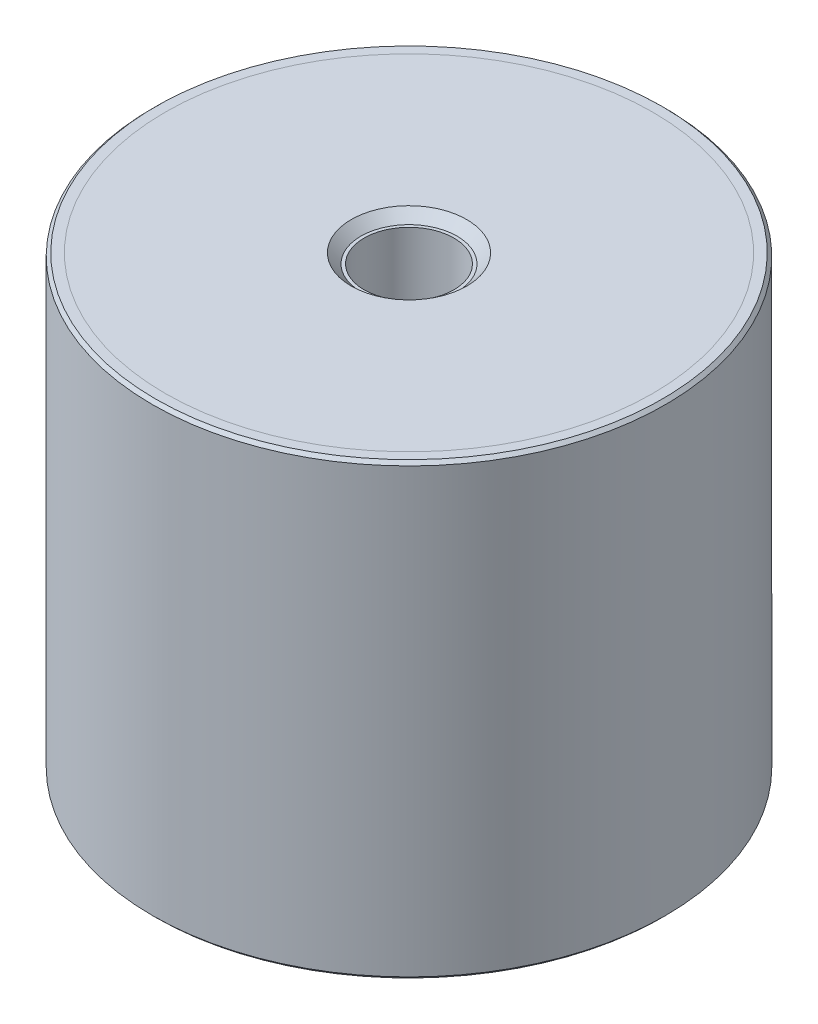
ISO-10303-21;
HEADER;
FILE_DESCRIPTION(('STEP AP214'),'2;1');
FILE_NAME('part.step','',(''),(''),'','','');
FILE_SCHEMA(('AUTOMOTIVE_DESIGN { 1 0 10303 214 1 1 1 1 }'));
ENDSEC;
DATA;
#1=APPLICATION_CONTEXT('core data for automotive mechanical design processes');
#2=APPLICATION_PROTOCOL_DEFINITION('international standard','automotive_design',2000,#1);
#3=PRODUCT_CONTEXT('',#1,'mechanical');
#4=PRODUCT('Part','Part','',(#3));
#5=PRODUCT_RELATED_PRODUCT_CATEGORY('part','',(#4));
#6=PRODUCT_DEFINITION_FORMATION('','',#4);
#7=PRODUCT_DEFINITION_CONTEXT('part definition',#1,'design');
#8=PRODUCT_DEFINITION('design','',#6,#7);
#9=PRODUCT_DEFINITION_SHAPE('','',#8);
#10=(LENGTH_UNIT() NAMED_UNIT(*) SI_UNIT(.MILLI.,.METRE.));
#11=(NAMED_UNIT(*) PLANE_ANGLE_UNIT() SI_UNIT($,.RADIAN.));
#12=(NAMED_UNIT(*) SI_UNIT($,.STERADIAN.) SOLID_ANGLE_UNIT());
#13=UNCERTAINTY_MEASURE_WITH_UNIT(LENGTH_MEASURE(1.E-05),#10,'distance_accuracy_value','');
#14=(GEOMETRIC_REPRESENTATION_CONTEXT(3) GLOBAL_UNCERTAINTY_ASSIGNED_CONTEXT((#13)) GLOBAL_UNIT_ASSIGNED_CONTEXT((#10,
#11,#12)) REPRESENTATION_CONTEXT('',''));
#15=CARTESIAN_POINT('',(0.,0.,0.));
#16=DIRECTION('',(0.,0.,1.));
#17=DIRECTION('',(1.,0.,0.));
#18=AXIS2_PLACEMENT_3D('',#15,#16,#17);
#19=CARTESIAN_POINT('',(0.,-67.,7.));
#20=DIRECTION('',(0.,1.,0.));
#21=DIRECTION('',(0.,0.,1.));
#22=AXIS2_PLACEMENT_3D('',#19,#20,#21);
#23=PLANE('',#22);
#24=CARTESIAN_POINT('',(0.,-67.,0.));
#25=DIRECTION('',(0.,1.,0.));
#26=DIRECTION('',(0.,0.,1.));
#27=AXIS2_PLACEMENT_3D('',#24,#25,#26);
#28=CIRCLE('',#27,7.50000000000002);
#29=CARTESIAN_POINT('',(0.,-67.,7.50000000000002));
#30=VERTEX_POINT('',#29);
#31=EDGE_CURVE('P0_E10',#30,#30,#28,.F.);
#32=ORIENTED_EDGE('',*,*,#31,.T.);
#33=EDGE_LOOP('',(#32));
#34=FACE_BOUND('',#33,.T.);
#35=CARTESIAN_POINT('',(0.,-67.,0.));
#36=DIRECTION('',(0.,1.,0.));
#37=DIRECTION('',(0.,0.,1.));
#38=AXIS2_PLACEMENT_3D('',#35,#36,#37);
#39=CIRCLE('',#38,38.);
#40=CARTESIAN_POINT('',(0.,-67.,38.));
#41=VERTEX_POINT('',#40);
#42=EDGE_CURVE('P0_E25',#41,#41,#39,.T.);
#43=ORIENTED_EDGE('',*,*,#42,.T.);
#44=EDGE_LOOP('',(#43));
#45=FACE_BOUND('',#44,.T.);
#46=ADVANCED_FACE('P0_F14',(#34,#45),#23,.T.);
#47=CARTESIAN_POINT('',(0.,1.0340428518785,0.));
#48=DIRECTION('',(0.,1.,0.));
#49=DIRECTION('',(0.,0.,1.));
#50=AXIS2_PLACEMENT_3D('',#47,#48,#49);
#51=CYLINDRICAL_SURFACE('',#50,38.);
#52=CARTESIAN_POINT('',(0.,-68.5,0.));
#53=DIRECTION('',(0.,1.,0.));
#54=DIRECTION('',(0.,0.,1.));
#55=AXIS2_PLACEMENT_3D('',#52,#53,#54);
#56=CIRCLE('',#55,38.);
#57=CARTESIAN_POINT('',(0.,-68.5,38.));
#58=VERTEX_POINT('',#57);
#59=EDGE_CURVE('P0_E29',#58,#58,#56,.T.);
#60=ORIENTED_EDGE('',*,*,#59,.T.);
#61=EDGE_LOOP('',(#60));
#62=FACE_BOUND('',#61,.T.);
#63=ORIENTED_EDGE('',*,*,#42,.F.);
#64=EDGE_LOOP('',(#63));
#65=FACE_BOUND('',#64,.T.);
#66=ADVANCED_FACE('P0_F35',(#62,#65),#51,.T.);
#67=CARTESIAN_POINT('',(0.,-68.5,38.));
#68=DIRECTION('',(0.,-1.,0.));
#69=DIRECTION('',(0.,0.,-1.));
#70=AXIS2_PLACEMENT_3D('',#67,#68,#69);
#71=PLANE('',#70);
#72=CARTESIAN_POINT('',(0.,-68.5,0.));
#73=DIRECTION('',(0.,-1.,0.));
#74=DIRECTION('',(0.,0.,-1.));
#75=AXIS2_PLACEMENT_3D('',#72,#73,#74);
#76=CIRCLE('',#75,9.00000000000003);
#77=CARTESIAN_POINT('',(0.,-68.5,-9.00000000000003));
#78=VERTEX_POINT('',#77);
#79=EDGE_CURVE('P0_E21',#78,#78,#76,.F.);
#80=ORIENTED_EDGE('',*,*,#79,.T.);
#81=EDGE_LOOP('',(#80));
#82=FACE_BOUND('',#81,.T.);
#83=ORIENTED_EDGE('',*,*,#59,.F.);
#84=EDGE_LOOP('',(#83));
#85=FACE_BOUND('',#84,.T.);
#86=ADVANCED_FACE('P0_F38',(#82,#85),#71,.T.);
#87=CARTESIAN_POINT('',(0.,-68.5,0.));
#88=DIRECTION('',(0.,-1.,0.));
#89=DIRECTION('',(0.,0.,-1.));
#90=AXIS2_PLACEMENT_3D('',#87,#88,#89);
#91=CONICAL_SURFACE('',#90,9.00000000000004,0.785398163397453);
#92=ORIENTED_EDGE('',*,*,#31,.F.);
#93=EDGE_LOOP('',(#92));
#94=FACE_BOUND('',#93,.T.);
#95=ORIENTED_EDGE('',*,*,#79,.F.);
#96=EDGE_LOOP('',(#95));
#97=FACE_BOUND('',#96,.T.);
#98=ADVANCED_FACE('P0_F16',(#94,#97),#91,.F.);
#99=CLOSED_SHELL('',(#46,#66,#86,#98));
#100=MANIFOLD_SOLID_BREP('P0_B1',#99);
#101=CARTESIAN_POINT('',(0.,1.5,7.));
#102=DIRECTION('',(0.,1.,0.));
#103=DIRECTION('',(0.,0.,1.));
#104=AXIS2_PLACEMENT_3D('',#101,#102,#103);
#105=PLANE('',#104);
#106=CARTESIAN_POINT('',(0.,1.5,0.));
#107=DIRECTION('',(0.,1.,0.));
#108=DIRECTION('',(0.,0.,1.));
#109=AXIS2_PLACEMENT_3D('',#106,#107,#108);
#110=CIRCLE('',#109,9.00000000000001);
#111=CARTESIAN_POINT('',(0.,1.5,9.00000000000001));
#112=VERTEX_POINT('',#111);
#113=EDGE_CURVE('P1_E10',#112,#112,#110,.F.);
#114=ORIENTED_EDGE('',*,*,#113,.T.);
#115=EDGE_LOOP('',(#114));
#116=FACE_BOUND('',#115,.T.);
#117=CARTESIAN_POINT('',(0.,1.5,0.));
#118=DIRECTION('',(0.,1.,0.));
#119=DIRECTION('',(0.,0.,1.));
#120=AXIS2_PLACEMENT_3D('',#117,#118,#119);
#121=CIRCLE('',#120,38.);
#122=CARTESIAN_POINT('',(0.,1.5,38.));
#123=VERTEX_POINT('',#122);
#124=EDGE_CURVE('P1_E25',#123,#123,#121,.T.);
#125=ORIENTED_EDGE('',*,*,#124,.T.);
#126=EDGE_LOOP('',(#125));
#127=FACE_BOUND('',#126,.T.);
#128=ADVANCED_FACE('P1_F14',(#116,#127),#105,.T.);
#129=CARTESIAN_POINT('',(0.,69.5340428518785,0.));
#130=DIRECTION('',(0.,1.,0.));
#131=DIRECTION('',(0.,0.,1.));
#132=AXIS2_PLACEMENT_3D('',#129,#130,#131);
#133=CYLINDRICAL_SURFACE('',#132,38.);
#134=CARTESIAN_POINT('',(0.,0.,0.));
#135=DIRECTION('',(0.,1.,0.));
#136=DIRECTION('',(0.,0.,1.));
#137=AXIS2_PLACEMENT_3D('',#134,#135,#136);
#138=CIRCLE('',#137,38.);
#139=CARTESIAN_POINT('',(0.,0.,38.));
#140=VERTEX_POINT('',#139);
#141=EDGE_CURVE('P1_E29',#140,#140,#138,.T.);
#142=ORIENTED_EDGE('',*,*,#141,.T.);
#143=EDGE_LOOP('',(#142));
#144=FACE_BOUND('',#143,.T.);
#145=ORIENTED_EDGE('',*,*,#124,.F.);
#146=EDGE_LOOP('',(#145));
#147=FACE_BOUND('',#146,.T.);
#148=ADVANCED_FACE('P1_F35',(#144,#147),#133,.T.);
#149=CARTESIAN_POINT('',(0.,0.,38.));
#150=DIRECTION('',(0.,-1.,0.));
#151=DIRECTION('',(0.,0.,-1.));
#152=AXIS2_PLACEMENT_3D('',#149,#150,#151);
#153=PLANE('',#152);
#154=CARTESIAN_POINT('',(0.,0.,0.));
#155=DIRECTION('',(0.,-1.,0.));
#156=DIRECTION('',(0.,0.,-1.));
#157=AXIS2_PLACEMENT_3D('',#154,#155,#156);
#158=CIRCLE('',#157,7.50000000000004);
#159=CARTESIAN_POINT('',(0.,0.,-7.50000000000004));
#160=VERTEX_POINT('',#159);
#161=EDGE_CURVE('P1_E21',#160,#160,#158,.F.);
#162=ORIENTED_EDGE('',*,*,#161,.T.);
#163=EDGE_LOOP('',(#162));
#164=FACE_BOUND('',#163,.T.);
#165=ORIENTED_EDGE('',*,*,#141,.F.);
#166=EDGE_LOOP('',(#165));
#167=FACE_BOUND('',#166,.T.);
#168=ADVANCED_FACE('P1_F38',(#164,#167),#153,.T.);
#169=CARTESIAN_POINT('',(0.,-0.500000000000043,0.));
#170=DIRECTION('',(0.,1.,0.));
#171=DIRECTION('',(0.,0.,1.));
#172=AXIS2_PLACEMENT_3D('',#169,#170,#171);
#173=CONICAL_SURFACE('',#172,7.,0.785398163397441);
#174=ORIENTED_EDGE('',*,*,#113,.F.);
#175=EDGE_LOOP('',(#174));
#176=FACE_BOUND('',#175,.T.);
#177=ORIENTED_EDGE('',*,*,#161,.F.);
#178=EDGE_LOOP('',(#177));
#179=FACE_BOUND('',#178,.T.);
#180=ADVANCED_FACE('P1_F16',(#176,#179),#173,.F.);
#181=CLOSED_SHELL('',(#128,#148,#168,#180));
#182=MANIFOLD_SOLID_BREP('P1_B1',#181);
#183=CARTESIAN_POINT('',(0.,0.,0.));
#184=DIRECTION('',(0.,1.,0.));
#185=DIRECTION('',(0.,0.,1.));
#186=AXIS2_PLACEMENT_3D('',#183,#184,#185);
#187=PLANE('',#186);
#188=CARTESIAN_POINT('',(0.,0.,0.));
#189=DIRECTION('',(0.,1.,0.));
#190=DIRECTION('',(0.,0.,1.));
#191=AXIS2_PLACEMENT_3D('',#188,#189,#190);
#192=CIRCLE('',#191,7.);
#193=CARTESIAN_POINT('',(0.,0.,7.));
#194=VERTEX_POINT('',#193);
#195=EDGE_CURVE('P2_E46',#194,#194,#192,.T.);
#196=ORIENTED_EDGE('',*,*,#195,.F.);
#197=EDGE_LOOP('',(#196));
#198=FACE_BOUND('',#197,.T.);
#199=CARTESIAN_POINT('',(0.,0.,0.));
#200=DIRECTION('',(0.,1.,0.));
#201=DIRECTION('',(0.,0.,1.));
#202=AXIS2_PLACEMENT_3D('',#199,#200,#201);
#203=CIRCLE('',#202,38.);
#204=CARTESIAN_POINT('',(0.,0.,38.));
#205=VERTEX_POINT('',#204);
#206=EDGE_CURVE('P2_E33',#205,#205,#203,.T.);
#207=ORIENTED_EDGE('',*,*,#206,.T.);
#208=EDGE_LOOP('',(#207));
#209=FACE_BOUND('',#208,.T.);
#210=ADVANCED_FACE('P2_F13',(#198,#209),#187,.T.);
#211=CARTESIAN_POINT('',(0.,65.5134936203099,0.));
#212=DIRECTION('',(0.,1.,0.));
#213=DIRECTION('',(0.,0.,1.));
#214=AXIS2_PLACEMENT_3D('',#211,#212,#213);
#215=CYLINDRICAL_SURFACE('',#214,38.);
#216=CARTESIAN_POINT('',(0.,1.5,0.));
#217=DIRECTION('',(0.,1.,0.));
#218=DIRECTION('',(0.,0.,1.));
#219=AXIS2_PLACEMENT_3D('',#216,#217,#218);
#220=CIRCLE('',#219,38.);
#221=CARTESIAN_POINT('',(0.,1.5,38.));
#222=VERTEX_POINT('',#221);
#223=EDGE_CURVE('P2_E36',#222,#222,#220,.T.);
#224=ORIENTED_EDGE('',*,*,#223,.T.);
#225=EDGE_LOOP('',(#224));
#226=FACE_BOUND('',#225,.T.);
#227=ORIENTED_EDGE('',*,*,#206,.F.);
#228=EDGE_LOOP('',(#227));
#229=FACE_BOUND('',#228,.T.);
#230=ADVANCED_FACE('P2_F92',(#226,#229),#215,.F.);
#231=CARTESIAN_POINT('',(0.,1.5,38.));
#232=DIRECTION('',(0.,1.,0.));
#233=DIRECTION('',(0.,0.,1.));
#234=AXIS2_PLACEMENT_3D('',#231,#232,#233);
#235=PLANE('',#234);
#236=CARTESIAN_POINT('',(0.,1.5,0.));
#237=DIRECTION('',(0.,1.,0.));
#238=DIRECTION('',(0.,0.,1.));
#239=AXIS2_PLACEMENT_3D('',#236,#237,#238);
#240=CIRCLE('',#239,39.5);
#241=CARTESIAN_POINT('',(0.,1.5,39.5));
#242=VERTEX_POINT('',#241);
#243=EDGE_CURVE('P2_E9',#242,#242,#240,.T.);
#244=ORIENTED_EDGE('',*,*,#243,.T.);
#245=EDGE_LOOP('',(#244));
#246=FACE_BOUND('',#245,.T.);
#247=ORIENTED_EDGE('',*,*,#223,.F.);
#248=EDGE_LOOP('',(#247));
#249=FACE_BOUND('',#248,.T.);
#250=ADVANCED_FACE('P2_F88',(#246,#249),#235,.T.);
#251=CARTESIAN_POINT('',(0.,65.5134936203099,0.));
#252=DIRECTION('',(0.,1.,0.));
#253=DIRECTION('',(0.,0.,1.));
#254=AXIS2_PLACEMENT_3D('',#251,#252,#253);
#255=CYLINDRICAL_SURFACE('',#254,40.);
#256=CARTESIAN_POINT('',(0.,-68.,0.));
#257=DIRECTION('',(0.,-1.,0.));
#258=DIRECTION('',(0.,0.,-1.));
#259=AXIS2_PLACEMENT_3D('',#256,#257,#258);
#260=CIRCLE('',#259,40.);
#261=CARTESIAN_POINT('',(0.,-68.,-40.));
#262=VERTEX_POINT('',#261);
#263=EDGE_CURVE('P2_E24',#262,#262,#260,.F.);
#264=ORIENTED_EDGE('',*,*,#263,.T.);
#265=EDGE_LOOP('',(#264));
#266=FACE_BOUND('',#265,.T.);
#267=CARTESIAN_POINT('',(0.,1.00000000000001,0.));
#268=DIRECTION('',(0.,1.,0.));
#269=DIRECTION('',(0.,0.,1.));
#270=AXIS2_PLACEMENT_3D('',#267,#268,#269);
#271=CIRCLE('',#270,40.);
#272=CARTESIAN_POINT('',(0.,1.00000000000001,40.));
#273=VERTEX_POINT('',#272);
#274=EDGE_CURVE('P2_E28',#273,#273,#271,.F.);
#275=ORIENTED_EDGE('',*,*,#274,.T.);
#276=EDGE_LOOP('',(#275));
#277=FACE_BOUND('',#276,.T.);
#278=ADVANCED_FACE('P2_F82',(#266,#277),#255,.T.);
#279=CARTESIAN_POINT('',(0.,-68.5,40.));
#280=DIRECTION('',(0.,-1.,0.));
#281=DIRECTION('',(0.,0.,-1.));
#282=AXIS2_PLACEMENT_3D('',#279,#280,#281);
#283=PLANE('',#282);
#284=CARTESIAN_POINT('',(0.,-68.5,0.));
#285=DIRECTION('',(0.,-1.,0.));
#286=DIRECTION('',(0.,0.,-1.));
#287=AXIS2_PLACEMENT_3D('',#284,#285,#286);
#288=CIRCLE('',#287,39.5);
#289=CARTESIAN_POINT('',(0.,-68.5,-39.5));
#290=VERTEX_POINT('',#289);
#291=EDGE_CURVE('P2_E20',#290,#290,#288,.T.);
#292=ORIENTED_EDGE('',*,*,#291,.T.);
#293=EDGE_LOOP('',(#292));
#294=FACE_BOUND('',#293,.T.);
#295=CARTESIAN_POINT('',(0.,-68.5,0.));
#296=DIRECTION('',(0.,1.,0.));
#297=DIRECTION('',(0.,0.,1.));
#298=AXIS2_PLACEMENT_3D('',#295,#296,#297);
#299=CIRCLE('',#298,38.);
#300=CARTESIAN_POINT('',(0.,-68.5,38.));
#301=VERTEX_POINT('',#300);
#302=EDGE_CURVE('P2_E39',#301,#301,#299,.T.);
#303=ORIENTED_EDGE('',*,*,#302,.T.);
#304=EDGE_LOOP('',(#303));
#305=FACE_BOUND('',#304,.T.);
#306=ADVANCED_FACE('P2_F77',(#294,#305),#283,.T.);
#307=CARTESIAN_POINT('',(0.,65.5134936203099,0.));
#308=DIRECTION('',(0.,1.,0.));
#309=DIRECTION('',(0.,0.,1.));
#310=AXIS2_PLACEMENT_3D('',#307,#308,#309);
#311=CYLINDRICAL_SURFACE('',#310,38.);
#312=CARTESIAN_POINT('',(0.,-67.,0.));
#313=DIRECTION('',(0.,1.,0.));
#314=DIRECTION('',(0.,0.,1.));
#315=AXIS2_PLACEMENT_3D('',#312,#313,#314);
#316=CIRCLE('',#315,38.);
#317=CARTESIAN_POINT('',(0.,-67.,38.));
#318=VERTEX_POINT('',#317);
#319=EDGE_CURVE('P2_E42',#318,#318,#316,.T.);
#320=ORIENTED_EDGE('',*,*,#319,.T.);
#321=EDGE_LOOP('',(#320));
#322=FACE_BOUND('',#321,.T.);
#323=ORIENTED_EDGE('',*,*,#302,.F.);
#324=EDGE_LOOP('',(#323));
#325=FACE_BOUND('',#324,.T.);
#326=ADVANCED_FACE('P2_F71',(#322,#325),#311,.F.);
#327=CARTESIAN_POINT('',(0.,-67.,38.));
#328=DIRECTION('',(0.,-1.,0.));
#329=DIRECTION('',(0.,0.,-1.));
#330=AXIS2_PLACEMENT_3D('',#327,#328,#329);
#331=PLANE('',#330);
#332=CARTESIAN_POINT('',(0.,-67.,0.));
#333=DIRECTION('',(0.,-1.,0.));
#334=DIRECTION('',(0.,0.,-1.));
#335=AXIS2_PLACEMENT_3D('',#332,#333,#334);
#336=CIRCLE('',#335,7.);
#337=CARTESIAN_POINT('',(0.,-67.,-7.));
#338=VERTEX_POINT('',#337);
#339=EDGE_CURVE('P2_E52',#338,#338,#336,.T.);
#340=ORIENTED_EDGE('',*,*,#339,.F.);
#341=EDGE_LOOP('',(#340));
#342=FACE_BOUND('',#341,.T.);
#343=ORIENTED_EDGE('',*,*,#319,.F.);
#344=EDGE_LOOP('',(#343));
#345=FACE_BOUND('',#344,.T.);
#346=ADVANCED_FACE('P2_F67',(#342,#345),#331,.T.);
#347=CARTESIAN_POINT('',(0.,-68.,0.));
#348=DIRECTION('',(0.,1.,0.));
#349=DIRECTION('',(0.,0.,1.));
#350=AXIS2_PLACEMENT_3D('',#347,#348,#349);
#351=CONICAL_SURFACE('',#350,40.,0.785398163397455);
#352=ORIENTED_EDGE('',*,*,#291,.F.);
#353=EDGE_LOOP('',(#352));
#354=FACE_BOUND('',#353,.T.);
#355=ORIENTED_EDGE('',*,*,#263,.F.);
#356=EDGE_LOOP('',(#355));
#357=FACE_BOUND('',#356,.T.);
#358=ADVANCED_FACE('P2_F70',(#354,#357),#351,.T.);
#359=CARTESIAN_POINT('',(0.,1.5,0.));
#360=DIRECTION('',(0.,-1.,0.));
#361=DIRECTION('',(0.,0.,-1.));
#362=AXIS2_PLACEMENT_3D('',#359,#360,#361);
#363=CONICAL_SURFACE('',#362,39.5,0.785398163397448);
#364=ORIENTED_EDGE('',*,*,#274,.F.);
#365=EDGE_LOOP('',(#364));
#366=FACE_BOUND('',#365,.T.);
#367=ORIENTED_EDGE('',*,*,#243,.F.);
#368=EDGE_LOOP('',(#367));
#369=FACE_BOUND('',#368,.T.);
#370=ADVANCED_FACE('P2_F15',(#366,#369),#363,.T.);
#371=CARTESIAN_POINT('',(0.,-12.5,0.));
#372=DIRECTION('',(0.,1.,0.));
#373=DIRECTION('',(0.,0.,1.));
#374=AXIS2_PLACEMENT_3D('',#371,#372,#373);
#375=CYLINDRICAL_SURFACE('',#374,7.);
#376=CARTESIAN_POINT('',(0.,-12.5,0.));
#377=DIRECTION('',(0.,1.,0.));
#378=DIRECTION('',(0.,0.,1.));
#379=AXIS2_PLACEMENT_3D('',#376,#377,#378);
#380=CIRCLE('',#379,7.);
#381=CARTESIAN_POINT('',(0.,-12.5,7.));
#382=VERTEX_POINT('',#381);
#383=EDGE_CURVE('P2_E45',#382,#382,#380,.T.);
#384=ORIENTED_EDGE('',*,*,#383,.F.);
#385=EDGE_LOOP('',(#384));
#386=FACE_BOUND('',#385,.T.);
#387=ORIENTED_EDGE('',*,*,#195,.T.);
#388=EDGE_LOOP('',(#387));
#389=FACE_BOUND('',#388,.T.);
#390=ADVANCED_FACE('P2_F108',(#386,#389),#375,.F.);
#391=CARTESIAN_POINT('',(0.,-12.5,0.));
#392=DIRECTION('',(0.,1.,0.));
#393=DIRECTION('',(0.,0.,1.));
#394=AXIS2_PLACEMENT_3D('',#391,#392,#393);
#395=PLANE('',#394);
#396=ORIENTED_EDGE('',*,*,#383,.T.);
#397=EDGE_LOOP('',(#396));
#398=FACE_BOUND('',#397,.T.);
#399=ADVANCED_FACE('P2_F63',(#398),#395,.T.);
#400=CARTESIAN_POINT('',(0.,-54.5,0.));
#401=DIRECTION('',(0.,-1.,0.));
#402=DIRECTION('',(0.,0.,-1.));
#403=AXIS2_PLACEMENT_3D('',#400,#401,#402);
#404=CYLINDRICAL_SURFACE('',#403,7.);
#405=CARTESIAN_POINT('',(0.,-54.5,0.));
#406=DIRECTION('',(0.,-1.,0.));
#407=DIRECTION('',(0.,0.,-1.));
#408=AXIS2_PLACEMENT_3D('',#405,#406,#407);
#409=CIRCLE('',#408,7.);
#410=CARTESIAN_POINT('',(0.,-54.5,-7.));
#411=VERTEX_POINT('',#410);
#412=EDGE_CURVE('P2_E49',#411,#411,#409,.T.);
#413=ORIENTED_EDGE('',*,*,#412,.F.);
#414=EDGE_LOOP('',(#413));
#415=FACE_BOUND('',#414,.T.);
#416=ORIENTED_EDGE('',*,*,#339,.T.);
#417=EDGE_LOOP('',(#416));
#418=FACE_BOUND('',#417,.T.);
#419=ADVANCED_FACE('P2_F60',(#415,#418),#404,.F.);
#420=CARTESIAN_POINT('',(0.,-54.5,0.));
#421=DIRECTION('',(0.,-1.,0.));
#422=DIRECTION('',(0.,0.,-1.));
#423=AXIS2_PLACEMENT_3D('',#420,#421,#422);
#424=PLANE('',#423);
#425=ORIENTED_EDGE('',*,*,#412,.T.);
#426=EDGE_LOOP('',(#425));
#427=FACE_BOUND('',#426,.T.);
#428=ADVANCED_FACE('P2_F58',(#427),#424,.T.);
#429=CLOSED_SHELL('',(#210,#230,#250,#278,#306,#326,#346,#358,#370,#390,#399,#419,#428));
#430=MANIFOLD_SOLID_BREP('P2_B1',#429);
#431=ADVANCED_BREP_SHAPE_REPRESENTATION('',(#18,#100,#182,#430),#14);
#432=SHAPE_DEFINITION_REPRESENTATION(#9,#431);
ENDSEC;
END-ISO-10303-21;
